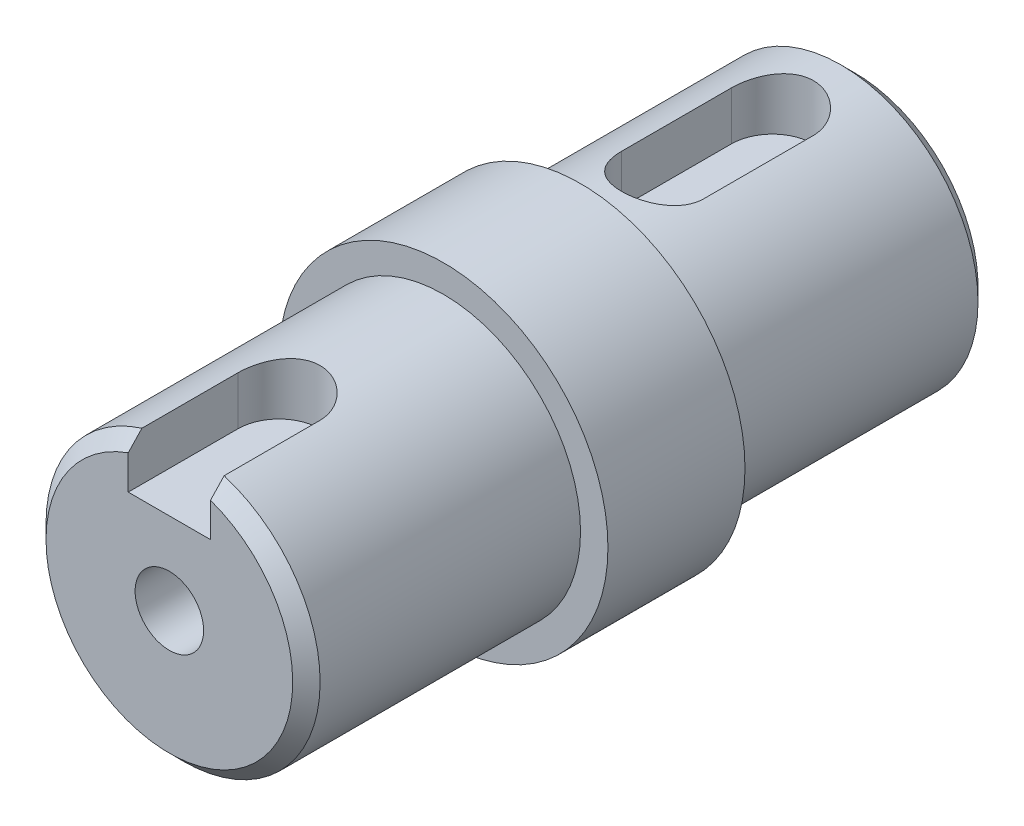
ISO-10303-21;
HEADER;
FILE_DESCRIPTION(('STEP AP214'),'2;1');
FILE_NAME('part.step','',(''),(''),'','','');
FILE_SCHEMA(('AUTOMOTIVE_DESIGN { 1 0 10303 214 1 1 1 1 }'));
ENDSEC;
DATA;
#1=APPLICATION_CONTEXT('core data for automotive mechanical design processes');
#2=APPLICATION_PROTOCOL_DEFINITION('international standard','automotive_design',2000,#1);
#3=PRODUCT_CONTEXT('',#1,'mechanical');
#4=PRODUCT('Part','Part','',(#3));
#5=PRODUCT_RELATED_PRODUCT_CATEGORY('part','',(#4));
#6=PRODUCT_DEFINITION_FORMATION('','',#4);
#7=PRODUCT_DEFINITION_CONTEXT('part definition',#1,'design');
#8=PRODUCT_DEFINITION('design','',#6,#7);
#9=PRODUCT_DEFINITION_SHAPE('','',#8);
#10=(LENGTH_UNIT() NAMED_UNIT(*) SI_UNIT(.MILLI.,.METRE.));
#11=(NAMED_UNIT(*) PLANE_ANGLE_UNIT() SI_UNIT($,.RADIAN.));
#12=(NAMED_UNIT(*) SI_UNIT($,.STERADIAN.) SOLID_ANGLE_UNIT());
#13=UNCERTAINTY_MEASURE_WITH_UNIT(LENGTH_MEASURE(1.E-05),#10,'distance_accuracy_value','');
#14=(GEOMETRIC_REPRESENTATION_CONTEXT(3) GLOBAL_UNCERTAINTY_ASSIGNED_CONTEXT((#13)) GLOBAL_UNIT_ASSIGNED_CONTEXT((#10,
#11,#12)) REPRESENTATION_CONTEXT('',''));
#15=CARTESIAN_POINT('',(0.,0.,0.));
#16=DIRECTION('',(0.,0.,1.));
#17=DIRECTION('',(1.,0.,0.));
#18=AXIS2_PLACEMENT_3D('',#15,#16,#17);
#19=CARTESIAN_POINT('',(0.,0.,10.));
#20=DIRECTION('',(0.,0.,-1.));
#21=DIRECTION('',(-1.,0.,0.));
#22=AXIS2_PLACEMENT_3D('',#19,#20,#21);
#23=CYLINDRICAL_SURFACE('',#22,5.);
#24=CARTESIAN_POINT('',(0.,0.,0.));
#25=DIRECTION('',(0.,0.,-1.));
#26=DIRECTION('',(-1.,0.,0.));
#27=AXIS2_PLACEMENT_3D('',#24,#25,#26);
#28=CIRCLE('',#27,5.);
#29=CARTESIAN_POINT('',(-5.,0.,0.));
#30=VERTEX_POINT('',#29);
#31=EDGE_CURVE('E170',#30,#30,#28,.T.);
#32=ORIENTED_EDGE('',*,*,#31,.F.);
#33=EDGE_LOOP('',(#32));
#34=FACE_BOUND('',#33,.T.);
#35=DIRECTION('',(0.,0.,-1.));
#36=VECTOR('',#35,1.);
#37=CARTESIAN_POINT('',(1.5,4.76969600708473,10.));
#38=LINE('',#37,#36);
#39=CARTESIAN_POINT('',(1.5,4.76969600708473,9.49999999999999));
#40=VERTEX_POINT('',#39);
#41=CARTESIAN_POINT('',(1.5,4.76969600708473,6.));
#42=VERTEX_POINT('',#41);
#43=EDGE_CURVE('E141',#40,#42,#38,.T.);
#44=ORIENTED_EDGE('',*,*,#43,.F.);
#45=CARTESIAN_POINT('',(0.,0.,9.49999999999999));
#46=DIRECTION('',(0.,0.,1.));
#47=DIRECTION('',(1.,0.,0.));
#48=AXIS2_PLACEMENT_3D('',#45,#46,#47);
#49=CIRCLE('',#48,5.);
#50=CARTESIAN_POINT('',(-1.5,4.76969600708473,9.49999999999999));
#51=VERTEX_POINT('',#50);
#52=EDGE_CURVE('E50',#40,#51,#49,.F.);
#53=ORIENTED_EDGE('',*,*,#52,.T.);
#54=DIRECTION('',(0.,0.,-1.));
#55=VECTOR('',#54,1.);
#56=CARTESIAN_POINT('',(-1.5,4.76969600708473,10.));
#57=LINE('',#56,#55);
#58=CARTESIAN_POINT('',(-1.5,4.76969600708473,6.));
#59=VERTEX_POINT('',#58);
#60=EDGE_CURVE('E139',#59,#51,#57,.F.);
#61=ORIENTED_EDGE('',*,*,#60,.F.);
#62=CARTESIAN_POINT('',(0.,5.,4.5));
#63=CARTESIAN_POINT('',(-0.0822886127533,4.9999992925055,4.50000099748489));
#64=CARTESIAN_POINT('',(-0.164587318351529,4.99794915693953,4.50679386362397));
#65=CARTESIAN_POINT('',(-0.326788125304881,4.98997105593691,4.5337213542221));
#66=CARTESIAN_POINT('',(-0.40668950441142,4.98404193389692,4.55385995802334));
#67=CARTESIAN_POINT('',(-0.561732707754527,4.96895552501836,4.60674601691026));
#68=CARTESIAN_POINT('',(-0.636881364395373,4.95980300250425,4.63947486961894));
#69=CARTESIAN_POINT('',(-0.780624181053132,4.93922109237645,4.71653609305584));
#70=CARTESIAN_POINT('',(-0.84921746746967,4.92779140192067,4.76087000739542));
#71=CARTESIAN_POINT('',(-0.979871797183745,4.90350737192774,4.86122400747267));
#72=CARTESIAN_POINT('',(-1.04171807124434,4.89062383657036,4.91751662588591));
#73=CARTESIAN_POINT('',(-1.15524920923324,4.86505834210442,5.03960922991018));
#74=CARTESIAN_POINT('',(-1.20693236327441,4.85237641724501,5.10541081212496));
#75=CARTESIAN_POINT('',(-1.29980037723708,4.82834113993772,5.24647075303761));
#76=CARTESIAN_POINT('',(-1.34072309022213,4.81702406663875,5.32190846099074));
#77=CARTESIAN_POINT('',(-1.4092139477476,4.79743620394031,5.47898925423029));
#78=CARTESIAN_POINT('',(-1.43678529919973,4.78916468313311,5.56063084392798));
#79=CARTESIAN_POINT('',(-1.47701633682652,4.77690870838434,5.72539026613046));
#80=CARTESIAN_POINT('',(-1.49007196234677,4.77281069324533,5.80840274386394));
#81=CARTESIAN_POINT('',(-1.50213730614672,4.76902789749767,5.97553315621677));
#82=CARTESIAN_POINT('',(-1.50115042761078,4.76934204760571,6.05965081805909));
#83=CARTESIAN_POINT('',(-1.48546977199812,4.77424744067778,6.22338390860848));
#84=CARTESIAN_POINT('',(-1.47127205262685,4.7786838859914,6.30305225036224));
#85=CARTESIAN_POINT('',(-1.43037420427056,4.79108356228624,6.45881978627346));
#86=CARTESIAN_POINT('',(-1.40367284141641,4.7990471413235,6.53491862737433));
#87=CARTESIAN_POINT('',(-1.33816026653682,4.81772733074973,6.68260034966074));
#88=CARTESIAN_POINT('',(-1.29918816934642,4.82848016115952,6.75410708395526));
#89=CARTESIAN_POINT('',(-1.21035222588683,4.85150987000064,6.88973202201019));
#90=CARTESIAN_POINT('',(-1.16048574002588,4.86378711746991,6.95384842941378));
#91=CARTESIAN_POINT('',(-1.04881290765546,4.88911011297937,7.07568619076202));
#92=CARTESIAN_POINT('',(-0.986594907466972,4.90216654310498,7.13302866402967));
#93=CARTESIAN_POINT('',(-0.853263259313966,4.92712244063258,7.23655398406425));
#94=CARTESIAN_POINT('',(-0.782149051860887,4.9390218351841,7.28273612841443));
#95=CARTESIAN_POINT('',(-0.632355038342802,4.9604316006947,7.36285992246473));
#96=CARTESIAN_POINT('',(-0.553627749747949,4.96992543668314,7.39671751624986));
#97=CARTESIAN_POINT('',(-0.391245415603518,4.98533521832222,7.45059959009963));
#98=CARTESIAN_POINT('',(-0.307591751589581,4.99125216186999,7.47062792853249));
#99=CARTESIAN_POINT('',(-0.140952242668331,4.99868364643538,7.4956521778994));
#100=CARTESIAN_POINT('',(-0.0580500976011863,5.0003485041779,7.50116158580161));
#101=CARTESIAN_POINT('',(0.107499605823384,4.99952923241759,7.49843084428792));
#102=CARTESIAN_POINT('',(0.190147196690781,4.99704565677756,7.49019253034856));
#103=CARTESIAN_POINT('',(0.350903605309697,4.98830696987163,7.4606153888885));
#104=CARTESIAN_POINT('',(0.429072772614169,4.98213829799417,7.43957661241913));
#105=CARTESIAN_POINT('',(0.580754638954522,4.96674347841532,7.3853567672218));
#106=CARTESIAN_POINT('',(0.654266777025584,4.95751696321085,7.35217423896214));
#107=CARTESIAN_POINT('',(0.796437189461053,4.93669654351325,7.27374683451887));
#108=CARTESIAN_POINT('',(0.86494382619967,4.92505280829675,7.22824065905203));
#109=CARTESIAN_POINT('',(0.993523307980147,4.90073468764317,7.12677524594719));
#110=CARTESIAN_POINT('',(1.05359403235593,4.8880600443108,7.07081338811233));
#111=CARTESIAN_POINT('',(1.16585744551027,4.86253171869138,6.94761269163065));
#112=CARTESIAN_POINT('',(1.21768481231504,4.84968825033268,6.88003812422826));
#113=CARTESIAN_POINT('',(1.30928995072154,4.82576515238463,6.73687206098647));
#114=CARTESIAN_POINT('',(1.34906803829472,4.81468547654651,6.66128077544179));
#115=CARTESIAN_POINT('',(1.41517347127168,4.79567189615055,6.50446750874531));
#116=CARTESIAN_POINT('',(1.4415634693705,4.78772337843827,6.42327381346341));
#117=CARTESIAN_POINT('',(1.48021730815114,4.77591594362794,6.25731203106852));
#118=CARTESIAN_POINT('',(1.49248598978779,4.772055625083,6.17254517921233));
#119=CARTESIAN_POINT('',(1.50221984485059,4.76899972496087,6.00563848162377));
#120=CARTESIAN_POINT('',(1.5002805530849,4.76961647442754,5.92353634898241));
#121=CARTESIAN_POINT('',(1.48307505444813,4.77499401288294,5.7608858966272));
#122=CARTESIAN_POINT('',(1.46780938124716,4.77975463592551,5.68033751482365));
#123=CARTESIAN_POINT('',(1.42476888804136,4.79275763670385,5.52405460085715));
#124=CARTESIAN_POINT('',(1.39715175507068,4.80095604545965,5.44827271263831));
#125=CARTESIAN_POINT('',(1.33031507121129,4.81990278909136,5.30235756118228));
#126=CARTESIAN_POINT('',(1.29109329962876,4.83065161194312,5.23222538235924));
#127=CARTESIAN_POINT('',(1.20048763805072,4.85397676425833,5.09683688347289));
#128=CARTESIAN_POINT('',(1.14871276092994,4.86660540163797,5.03185123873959));
#129=CARTESIAN_POINT('',(1.03517434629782,4.89201320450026,4.91129750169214));
#130=CARTESIAN_POINT('',(0.973408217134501,4.90479240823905,4.85573186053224));
#131=CARTESIAN_POINT('',(0.839465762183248,4.92950936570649,4.75397658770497));
#132=CARTESIAN_POINT('',(0.767037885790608,4.94141159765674,4.70810855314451));
#133=CARTESIAN_POINT('',(0.61514137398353,4.96260680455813,4.62926483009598));
#134=CARTESIAN_POINT('',(0.535676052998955,4.97190099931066,4.59628311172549));
#135=CARTESIAN_POINT('',(0.380757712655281,4.98602174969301,4.54710472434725));
#136=CARTESIAN_POINT('',(0.305786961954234,4.99122027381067,4.52948832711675));
#137=CARTESIAN_POINT('',(0.153880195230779,4.99820944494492,4.50593647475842));
#138=CARTESIAN_POINT('',(0.0769445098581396,5.0000006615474,4.49999906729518));
#139=CARTESIAN_POINT('',(0.,5.,4.5));
#140=B_SPLINE_CURVE_WITH_KNOTS('',3,(#62,#63,#64,#65,#66,#67,#68,#69,#70,#71,#72,#73,#74,#75,
#76,#77,#78,#79,#80,#81,#82,#83,#84,#85,#86,#87,#88,#89,#90,#91,#92,#93,#94,#95,#96,#97,#98,#99,
#100,#101,#102,#103,#104,#105,#106,#107,#108,#109,#110,#111,#112,#113,#114,#115,#116,#117,#118,
#119,#120,#121,#122,#123,#124,#125,#126,#127,#128,#129,#130,#131,#132,#133,#134,#135,#136,#137,
#138,#139),.UNSPECIFIED.,.T.,.F.,(4,2,2,2,2,2,2,2,2,2,2,2,2,2,2,2,2,2,2,2,2,2,2,2,2,2,2,2,2,2,2,
2,2,2,2,2,2,2,4),(0.,0.246583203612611,0.493239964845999,0.739533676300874,0.985860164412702,
1.23855602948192,1.49129437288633,1.74971481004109,2.00807314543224,2.25919689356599,
2.51025978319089,2.75226016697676,2.99428443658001,3.23962426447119,3.48502360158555,
3.74067104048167,3.99633456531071,4.25371046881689,4.51101453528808,4.75908809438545,
5.00712853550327,5.24956746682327,5.49203554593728,5.74011305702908,5.98825282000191,
6.24540400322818,6.5025484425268,6.75847814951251,7.01432009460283,7.25950155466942,
7.504673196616,7.74680040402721,7.98897397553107,8.23996925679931,8.49102974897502,
8.7494299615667,9.00770911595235,9.23831691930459,9.46888616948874),.UNSPECIFIED.);
#141=EDGE_CURVE('E219',#42,#59,#140,.T.);
#142=ORIENTED_EDGE('',*,*,#141,.F.);
#143=EDGE_LOOP('',(#44,#53,#61,#142));
#144=FACE_BOUND('',#143,.T.);
#145=ADVANCED_FACE('F37',(#34,#144),#23,.T.);
#146=CARTESIAN_POINT('',(0.,0.,10.));
#147=DIRECTION('',(0.,0.,1.));
#148=DIRECTION('',(1.,0.,0.));
#149=AXIS2_PLACEMENT_3D('',#146,#147,#148);
#150=PLANE('',#149);
#151=CARTESIAN_POINT('',(0.,0.,10.));
#152=DIRECTION('',(0.,0.,1.));
#153=DIRECTION('',(1.,0.,0.));
#154=AXIS2_PLACEMENT_3D('',#151,#152,#153);
#155=CIRCLE('',#154,1.25);
#156=CARTESIAN_POINT('',(1.25,0.,10.));
#157=VERTEX_POINT('',#156);
#158=EDGE_CURVE('E123',#157,#157,#155,.T.);
#159=ORIENTED_EDGE('',*,*,#158,.F.);
#160=EDGE_LOOP('',(#159));
#161=FACE_BOUND('',#160,.T.);
#162=DIRECTION('',(0.,1.,0.));
#163=VECTOR('',#162,1.);
#164=CARTESIAN_POINT('',(-1.5,0.,10.));
#165=LINE('',#164,#163);
#166=CARTESIAN_POINT('',(-1.5,3.,10.));
#167=VERTEX_POINT('',#166);
#168=CARTESIAN_POINT('',(-1.5,4.24264068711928,10.));
#169=VERTEX_POINT('',#168);
#170=EDGE_CURVE('E214',#167,#169,#165,.T.);
#171=ORIENTED_EDGE('',*,*,#170,.T.);
#172=CARTESIAN_POINT('',(0.,0.,10.));
#173=DIRECTION('',(0.,0.,1.));
#174=DIRECTION('',(1.,0.,0.));
#175=AXIS2_PLACEMENT_3D('',#172,#173,#174);
#176=CIRCLE('',#175,4.5);
#177=CARTESIAN_POINT('',(1.5,4.24264068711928,10.));
#178=VERTEX_POINT('',#177);
#179=EDGE_CURVE('E246',#169,#178,#176,.T.);
#180=ORIENTED_EDGE('',*,*,#179,.T.);
#181=DIRECTION('',(0.,-1.,0.));
#182=VECTOR('',#181,1.);
#183=CARTESIAN_POINT('',(1.5,0.,10.));
#184=LINE('',#183,#182);
#185=CARTESIAN_POINT('',(1.5,3.,10.));
#186=VERTEX_POINT('',#185);
#187=EDGE_CURVE('E217',#178,#186,#184,.T.);
#188=ORIENTED_EDGE('',*,*,#187,.T.);
#189=DIRECTION('',(-1.,0.,0.));
#190=VECTOR('',#189,1.);
#191=CARTESIAN_POINT('',(0.,3.,10.));
#192=LINE('',#191,#190);
#193=EDGE_CURVE('E211',#186,#167,#192,.T.);
#194=ORIENTED_EDGE('',*,*,#193,.T.);
#195=EDGE_LOOP('',(#171,#180,#188,#194));
#196=FACE_BOUND('',#195,.T.);
#197=ADVANCED_FACE('F267',(#161,#196),#150,.T.);
#198=CARTESIAN_POINT('',(0.,0.,-15.));
#199=DIRECTION('',(0.,0.,1.));
#200=DIRECTION('',(1.,0.,0.));
#201=AXIS2_PLACEMENT_3D('',#198,#199,#200);
#202=CYLINDRICAL_SURFACE('',#201,5.);
#203=CARTESIAN_POINT('',(0.,0.,-14.5));
#204=DIRECTION('',(0.,0.,-1.));
#205=DIRECTION('',(-1.,0.,0.));
#206=AXIS2_PLACEMENT_3D('',#203,#204,#205);
#207=CIRCLE('',#206,5.);
#208=CARTESIAN_POINT('',(-5.,0.,-14.5));
#209=VERTEX_POINT('',#208);
#210=EDGE_CURVE('E248',#209,#209,#207,.F.);
#211=ORIENTED_EDGE('',*,*,#210,.T.);
#212=EDGE_LOOP('',(#211));
#213=FACE_BOUND('',#212,.T.);
#214=CARTESIAN_POINT('',(0.,0.,-5.));
#215=DIRECTION('',(0.,0.,-1.));
#216=DIRECTION('',(-1.,0.,0.));
#217=AXIS2_PLACEMENT_3D('',#214,#215,#216);
#218=CIRCLE('',#217,5.);
#219=CARTESIAN_POINT('',(-5.,0.,-5.));
#220=VERTEX_POINT('',#219);
#221=EDGE_CURVE('E163',#220,#220,#218,.T.);
#222=ORIENTED_EDGE('',*,*,#221,.T.);
#223=EDGE_LOOP('',(#222));
#224=FACE_BOUND('',#223,.T.);
#225=CARTESIAN_POINT('',(0.,5.,-13.5));
#226=CARTESIAN_POINT('',(-0.0822886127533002,4.9999992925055,-13.4999990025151));
#227=CARTESIAN_POINT('',(-0.16458731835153,4.99794915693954,-13.493206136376));
#228=CARTESIAN_POINT('',(-0.326788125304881,4.98997105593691,-13.4662786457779));
#229=CARTESIAN_POINT('',(-0.40668950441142,4.98404193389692,-13.4461400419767));
#230=CARTESIAN_POINT('',(-0.561732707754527,4.96895552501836,-13.3932539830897));
#231=CARTESIAN_POINT('',(-0.636881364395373,4.95980300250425,-13.3605251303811));
#232=CARTESIAN_POINT('',(-0.780624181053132,4.93922109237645,-13.2834639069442));
#233=CARTESIAN_POINT('',(-0.84921746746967,4.92779140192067,-13.2391299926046));
#234=CARTESIAN_POINT('',(-0.979871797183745,4.90350737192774,-13.1387759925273));
#235=CARTESIAN_POINT('',(-1.04171807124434,4.89062383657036,-13.0824833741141));
#236=CARTESIAN_POINT('',(-1.15524920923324,4.86505834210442,-12.9603907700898));
#237=CARTESIAN_POINT('',(-1.20693236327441,4.85237641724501,-12.894589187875));
#238=CARTESIAN_POINT('',(-1.29980037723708,4.82834113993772,-12.7535292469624));
#239=CARTESIAN_POINT('',(-1.34072309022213,4.81702406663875,-12.6780915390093));
#240=CARTESIAN_POINT('',(-1.4092139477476,4.79743620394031,-12.5210107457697));
#241=CARTESIAN_POINT('',(-1.43678529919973,4.78916468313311,-12.439369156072));
#242=CARTESIAN_POINT('',(-1.47701633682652,4.77690870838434,-12.2746097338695));
#243=CARTESIAN_POINT('',(-1.49007196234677,4.77281069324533,-12.1915972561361));
#244=CARTESIAN_POINT('',(-1.50213730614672,4.76902789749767,-12.0244668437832));
#245=CARTESIAN_POINT('',(-1.50115042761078,4.76934204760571,-11.9403491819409));
#246=CARTESIAN_POINT('',(-1.48546977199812,4.77424744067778,-11.7766160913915));
#247=CARTESIAN_POINT('',(-1.47127205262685,4.77868388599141,-11.6969477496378));
#248=CARTESIAN_POINT('',(-1.43037420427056,4.79108356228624,-11.5411802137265));
#249=CARTESIAN_POINT('',(-1.40367284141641,4.79904714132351,-11.4650813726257));
#250=CARTESIAN_POINT('',(-1.33816026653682,4.81772733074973,-11.3173996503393));
#251=CARTESIAN_POINT('',(-1.29918816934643,4.82848016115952,-11.2458929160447));
#252=CARTESIAN_POINT('',(-1.21035222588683,4.85150987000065,-11.1102679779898));
#253=CARTESIAN_POINT('',(-1.16048574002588,4.86378711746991,-11.0461515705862));
#254=CARTESIAN_POINT('',(-1.04881290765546,4.88911011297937,-10.924313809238));
#255=CARTESIAN_POINT('',(-0.986594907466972,4.90216654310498,-10.8669713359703));
#256=CARTESIAN_POINT('',(-0.853263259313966,4.92712244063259,-10.7634460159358));
#257=CARTESIAN_POINT('',(-0.782149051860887,4.9390218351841,-10.7172638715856));
#258=CARTESIAN_POINT('',(-0.632355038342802,4.9604316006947,-10.6371400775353));
#259=CARTESIAN_POINT('',(-0.553627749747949,4.96992543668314,-10.6032824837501));
#260=CARTESIAN_POINT('',(-0.391245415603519,4.98533521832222,-10.5494004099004));
#261=CARTESIAN_POINT('',(-0.307591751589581,4.99125216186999,-10.5293720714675));
#262=CARTESIAN_POINT('',(-0.140952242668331,4.99868364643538,-10.5043478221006));
#263=CARTESIAN_POINT('',(-0.0580500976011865,5.0003485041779,-10.4988384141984));
#264=CARTESIAN_POINT('',(0.107499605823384,4.9995292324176,-10.5015691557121));
#265=CARTESIAN_POINT('',(0.190147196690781,4.99704565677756,-10.5098074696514));
#266=CARTESIAN_POINT('',(0.350903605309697,4.98830696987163,-10.5393846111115));
#267=CARTESIAN_POINT('',(0.42907277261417,4.98213829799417,-10.5604233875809));
#268=CARTESIAN_POINT('',(0.580754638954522,4.96674347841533,-10.6146432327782));
#269=CARTESIAN_POINT('',(0.654266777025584,4.95751696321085,-10.6478257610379));
#270=CARTESIAN_POINT('',(0.796437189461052,4.93669654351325,-10.7262531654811));
#271=CARTESIAN_POINT('',(0.86494382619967,4.92505280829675,-10.771759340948));
#272=CARTESIAN_POINT('',(0.993523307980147,4.90073468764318,-10.8732247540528));
#273=CARTESIAN_POINT('',(1.05359403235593,4.8880600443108,-10.9291866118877));
#274=CARTESIAN_POINT('',(1.16585744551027,4.86253171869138,-11.0523873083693));
#275=CARTESIAN_POINT('',(1.21768481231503,4.84968825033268,-11.1199618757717));
#276=CARTESIAN_POINT('',(1.30928995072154,4.82576515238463,-11.2631279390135));
#277=CARTESIAN_POINT('',(1.34906803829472,4.81468547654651,-11.3387192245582));
#278=CARTESIAN_POINT('',(1.41517347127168,4.79567189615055,-11.4955324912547));
#279=CARTESIAN_POINT('',(1.4415634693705,4.78772337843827,-11.5767261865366));
#280=CARTESIAN_POINT('',(1.48021730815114,4.77591594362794,-11.7426879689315));
#281=CARTESIAN_POINT('',(1.49248598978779,4.772055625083,-11.8274548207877));
#282=CARTESIAN_POINT('',(1.50221984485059,4.76899972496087,-11.9943615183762));
#283=CARTESIAN_POINT('',(1.5002805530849,4.76961647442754,-12.0764636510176));
#284=CARTESIAN_POINT('',(1.48307505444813,4.77499401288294,-12.2391141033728));
#285=CARTESIAN_POINT('',(1.46780938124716,4.77975463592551,-12.3196624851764));
#286=CARTESIAN_POINT('',(1.42476888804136,4.79275763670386,-12.4759453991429));
#287=CARTESIAN_POINT('',(1.39715175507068,4.80095604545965,-12.5517272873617));
#288=CARTESIAN_POINT('',(1.33031507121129,4.81990278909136,-12.6976424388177));
#289=CARTESIAN_POINT('',(1.29109329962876,4.83065161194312,-12.7677746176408));
#290=CARTESIAN_POINT('',(1.20048763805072,4.85397676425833,-12.9031631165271));
#291=CARTESIAN_POINT('',(1.14871276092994,4.86660540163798,-12.9681487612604));
#292=CARTESIAN_POINT('',(1.03517434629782,4.89201320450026,-13.0887024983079));
#293=CARTESIAN_POINT('',(0.973408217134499,4.90479240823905,-13.1442681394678));
#294=CARTESIAN_POINT('',(0.839465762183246,4.92950936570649,-13.246023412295));
#295=CARTESIAN_POINT('',(0.767037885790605,4.94141159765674,-13.2918914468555));
#296=CARTESIAN_POINT('',(0.615141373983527,4.96260680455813,-13.370735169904));
#297=CARTESIAN_POINT('',(0.535676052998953,4.97190099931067,-13.4037168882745));
#298=CARTESIAN_POINT('',(0.380757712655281,4.98602174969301,-13.4528952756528));
#299=CARTESIAN_POINT('',(0.305786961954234,4.99122027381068,-13.4705116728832));
#300=CARTESIAN_POINT('',(0.153880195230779,4.99820944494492,-13.4940635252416));
#301=CARTESIAN_POINT('',(0.0769445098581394,5.0000006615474,-13.5000009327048));
#302=CARTESIAN_POINT('',(0.,5.,-13.5));
#303=B_SPLINE_CURVE_WITH_KNOTS('',3,(#225,#226,#227,#228,#229,#230,#231,#232,#233,#234,#235,
#236,#237,#238,#239,#240,#241,#242,#243,#244,#245,#246,#247,#248,#249,#250,#251,#252,#253,#254,
#255,#256,#257,#258,#259,#260,#261,#262,#263,#264,#265,#266,#267,#268,#269,#270,#271,#272,#273,
#274,#275,#276,#277,#278,#279,#280,#281,#282,#283,#284,#285,#286,#287,#288,#289,#290,#291,#292,
#293,#294,#295,#296,#297,#298,#299,#300,#301,#302),.UNSPECIFIED.,.T.,.F.,(4,2,2,2,2,2,2,2,2,2,2,
2,2,2,2,2,2,2,2,2,2,2,2,2,2,2,2,2,2,2,2,2,2,2,2,2,2,2,4),(0.,0.246583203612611,0.493239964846,
0.739533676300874,0.985860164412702,1.23855602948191,1.49129437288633,1.74971481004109,
2.00807314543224,2.25919689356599,2.51025978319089,2.75226016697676,2.99428443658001,
3.23962426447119,3.48502360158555,3.74067104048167,3.99633456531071,4.25371046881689,
4.51101453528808,4.75908809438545,5.00712853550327,5.24956746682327,5.49203554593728,
5.74011305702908,5.98825282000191,6.24540400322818,6.5025484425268,6.75847814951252,
7.01432009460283,7.25950155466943,7.504673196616,7.74680040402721,7.98897397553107,
8.2399692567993,8.49102974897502,8.7494299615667,9.00770911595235,9.23831691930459,
9.46888616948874),.UNSPECIFIED.);
#304=CARTESIAN_POINT('',(1.5,4.76969600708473,-12.));
#305=VERTEX_POINT('',#304);
#306=CARTESIAN_POINT('',(-1.5,4.76969600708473,-12.));
#307=VERTEX_POINT('',#306);
#308=EDGE_CURVE('E207',#305,#307,#303,.T.);
#309=ORIENTED_EDGE('',*,*,#308,.F.);
#310=DIRECTION('',(0.,0.,1.));
#311=VECTOR('',#310,1.);
#312=CARTESIAN_POINT('',(1.5,4.76969600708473,-15.));
#313=LINE('',#312,#311);
#314=CARTESIAN_POINT('',(1.5,4.76969600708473,-8.));
#315=VERTEX_POINT('',#314);
#316=EDGE_CURVE('E175',#315,#305,#313,.F.);
#317=ORIENTED_EDGE('',*,*,#316,.F.);
#318=CARTESIAN_POINT('',(0.,5.,-9.5));
#319=CARTESIAN_POINT('',(-0.0822886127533,4.9999992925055,-9.49999900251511));
#320=CARTESIAN_POINT('',(-0.164587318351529,4.99794915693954,-9.49320613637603));
#321=CARTESIAN_POINT('',(-0.326788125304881,4.98997105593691,-9.4662786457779));
#322=CARTESIAN_POINT('',(-0.40668950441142,4.98404193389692,-9.44614004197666));
#323=CARTESIAN_POINT('',(-0.561732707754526,4.96895552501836,-9.39325398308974));
#324=CARTESIAN_POINT('',(-0.636881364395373,4.95980300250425,-9.36052513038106));
#325=CARTESIAN_POINT('',(-0.780624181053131,4.93922109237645,-9.28346390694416));
#326=CARTESIAN_POINT('',(-0.849217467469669,4.92779140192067,-9.23912999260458));
#327=CARTESIAN_POINT('',(-0.979871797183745,4.90350737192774,-9.13877599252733));
#328=CARTESIAN_POINT('',(-1.04171807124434,4.89062383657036,-9.08248337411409));
#329=CARTESIAN_POINT('',(-1.15524920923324,4.86505834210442,-8.96039077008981));
#330=CARTESIAN_POINT('',(-1.20693236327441,4.85237641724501,-8.89458918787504));
#331=CARTESIAN_POINT('',(-1.29980037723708,4.82834113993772,-8.75352924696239));
#332=CARTESIAN_POINT('',(-1.34072309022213,4.81702406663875,-8.67809153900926));
#333=CARTESIAN_POINT('',(-1.4092139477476,4.79743620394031,-8.52101074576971));
#334=CARTESIAN_POINT('',(-1.43678529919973,4.78916468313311,-8.43936915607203));
#335=CARTESIAN_POINT('',(-1.47701633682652,4.77690870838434,-8.27460973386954));
#336=CARTESIAN_POINT('',(-1.49007196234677,4.77281069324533,-8.19159725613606));
#337=CARTESIAN_POINT('',(-1.50213730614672,4.76902789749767,-8.02446684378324));
#338=CARTESIAN_POINT('',(-1.50115042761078,4.76934204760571,-7.94034918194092));
#339=CARTESIAN_POINT('',(-1.48546977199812,4.77424744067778,-7.77661609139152));
#340=CARTESIAN_POINT('',(-1.47127205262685,4.7786838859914,-7.69694774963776));
#341=CARTESIAN_POINT('',(-1.43037420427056,4.79108356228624,-7.54118021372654));
#342=CARTESIAN_POINT('',(-1.40367284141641,4.79904714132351,-7.46508137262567));
#343=CARTESIAN_POINT('',(-1.33816026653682,4.81772733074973,-7.31739965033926));
#344=CARTESIAN_POINT('',(-1.29918816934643,4.82848016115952,-7.24589291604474));
#345=CARTESIAN_POINT('',(-1.21035222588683,4.85150987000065,-7.11026797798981));
#346=CARTESIAN_POINT('',(-1.16048574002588,4.86378711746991,-7.04615157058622));
#347=CARTESIAN_POINT('',(-1.04881290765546,4.88911011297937,-6.92431380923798));
#348=CARTESIAN_POINT('',(-0.986594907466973,4.90216654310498,-6.86697133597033));
#349=CARTESIAN_POINT('',(-0.853263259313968,4.92712244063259,-6.76344601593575));
#350=CARTESIAN_POINT('',(-0.782149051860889,4.9390218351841,-6.71726387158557));
#351=CARTESIAN_POINT('',(-0.632355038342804,4.9604316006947,-6.63714007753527));
#352=CARTESIAN_POINT('',(-0.553627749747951,4.96992543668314,-6.60328248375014));
#353=CARTESIAN_POINT('',(-0.39124541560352,4.98533521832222,-6.54940040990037));
#354=CARTESIAN_POINT('',(-0.307591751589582,4.99125216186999,-6.52937207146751));
#355=CARTESIAN_POINT('',(-0.140952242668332,4.99868364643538,-6.50434782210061));
#356=CARTESIAN_POINT('',(-0.0580500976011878,5.0003485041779,-6.49883841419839));
#357=CARTESIAN_POINT('',(0.107499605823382,4.9995292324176,-6.50156915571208));
#358=CARTESIAN_POINT('',(0.19014719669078,4.99704565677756,-6.50980746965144));
#359=CARTESIAN_POINT('',(0.350903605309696,4.98830696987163,-6.5393846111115));
#360=CARTESIAN_POINT('',(0.429072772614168,4.98213829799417,-6.56042338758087));
#361=CARTESIAN_POINT('',(0.580754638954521,4.96674347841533,-6.6146432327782));
#362=CARTESIAN_POINT('',(0.654266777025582,4.95751696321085,-6.64782576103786));
#363=CARTESIAN_POINT('',(0.796437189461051,4.93669654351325,-6.72625316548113));
#364=CARTESIAN_POINT('',(0.864943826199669,4.92505280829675,-6.77175934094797));
#365=CARTESIAN_POINT('',(0.993523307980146,4.90073468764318,-6.87322475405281));
#366=CARTESIAN_POINT('',(1.05359403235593,4.8880600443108,-6.92918661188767));
#367=CARTESIAN_POINT('',(1.16585744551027,4.86253171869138,-7.05238730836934));
#368=CARTESIAN_POINT('',(1.21768481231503,4.84968825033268,-7.11996187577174));
#369=CARTESIAN_POINT('',(1.30928995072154,4.82576515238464,-7.26312793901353));
#370=CARTESIAN_POINT('',(1.34906803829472,4.81468547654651,-7.33871922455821));
#371=CARTESIAN_POINT('',(1.41517347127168,4.79567189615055,-7.49553249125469));
#372=CARTESIAN_POINT('',(1.4415634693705,4.78772337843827,-7.57672618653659));
#373=CARTESIAN_POINT('',(1.48021730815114,4.77591594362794,-7.74268796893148));
#374=CARTESIAN_POINT('',(1.49248598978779,4.772055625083,-7.82745482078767));
#375=CARTESIAN_POINT('',(1.50221984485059,4.76899972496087,-7.99436151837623));
#376=CARTESIAN_POINT('',(1.5002805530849,4.76961647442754,-8.07646365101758));
#377=CARTESIAN_POINT('',(1.48307505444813,4.77499401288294,-8.2391141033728));
#378=CARTESIAN_POINT('',(1.46780938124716,4.77975463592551,-8.31966248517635));
#379=CARTESIAN_POINT('',(1.42476888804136,4.79275763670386,-8.47594539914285));
#380=CARTESIAN_POINT('',(1.39715175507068,4.80095604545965,-8.55172728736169));
#381=CARTESIAN_POINT('',(1.33031507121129,4.81990278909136,-8.69764243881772));
#382=CARTESIAN_POINT('',(1.29109329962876,4.83065161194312,-8.76777461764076));
#383=CARTESIAN_POINT('',(1.20048763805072,4.85397676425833,-8.90316311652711));
#384=CARTESIAN_POINT('',(1.14871276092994,4.86660540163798,-8.96814876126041));
#385=CARTESIAN_POINT('',(1.03517434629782,4.89201320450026,-9.08870249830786));
#386=CARTESIAN_POINT('',(0.973408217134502,4.90479240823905,-9.14426813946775));
#387=CARTESIAN_POINT('',(0.83946576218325,4.92950936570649,-9.24602341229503));
#388=CARTESIAN_POINT('',(0.767037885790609,4.94141159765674,-9.29189144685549));
#389=CARTESIAN_POINT('',(0.61514137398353,4.96260680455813,-9.37073516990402));
#390=CARTESIAN_POINT('',(0.535676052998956,4.97190099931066,-9.40371688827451));
#391=CARTESIAN_POINT('',(0.380757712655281,4.98602174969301,-9.45289527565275));
#392=CARTESIAN_POINT('',(0.305786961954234,4.99122027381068,-9.47051167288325));
#393=CARTESIAN_POINT('',(0.153880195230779,4.99820944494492,-9.49406352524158));
#394=CARTESIAN_POINT('',(0.0769445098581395,5.0000006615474,-9.50000093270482));
#395=CARTESIAN_POINT('',(0.,5.,-9.5));
#396=B_SPLINE_CURVE_WITH_KNOTS('',3,(#318,#319,#320,#321,#322,#323,#324,#325,#326,#327,#328,
#329,#330,#331,#332,#333,#334,#335,#336,#337,#338,#339,#340,#341,#342,#343,#344,#345,#346,#347,
#348,#349,#350,#351,#352,#353,#354,#355,#356,#357,#358,#359,#360,#361,#362,#363,#364,#365,#366,
#367,#368,#369,#370,#371,#372,#373,#374,#375,#376,#377,#378,#379,#380,#381,#382,#383,#384,#385,
#386,#387,#388,#389,#390,#391,#392,#393,#394,#395),.UNSPECIFIED.,.T.,.F.,(4,2,2,2,2,2,2,2,2,2,2,
2,2,2,2,2,2,2,2,2,2,2,2,2,2,2,2,2,2,2,2,2,2,2,2,2,2,2,4),(0.,0.246583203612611,
0.493239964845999,0.739533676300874,0.985860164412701,1.23855602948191,1.49129437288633,
1.74971481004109,2.00807314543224,2.25919689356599,2.51025978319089,2.75226016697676,
2.99428443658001,3.23962426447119,3.48502360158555,3.74067104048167,3.99633456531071,
4.25371046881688,4.51101453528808,4.75908809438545,5.00712853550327,5.24956746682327,
5.49203554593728,5.74011305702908,5.98825282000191,6.24540400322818,6.5025484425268,
6.75847814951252,7.01432009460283,7.25950155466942,7.504673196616,7.74680040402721,
7.98897397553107,8.2399692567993,8.49102974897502,8.74942996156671,9.00770911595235,
9.2383169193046,9.46888616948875),.UNSPECIFIED.);
#397=CARTESIAN_POINT('',(-1.5,4.76969600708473,-8.));
#398=VERTEX_POINT('',#397);
#399=EDGE_CURVE('E177',#398,#315,#396,.T.);
#400=ORIENTED_EDGE('',*,*,#399,.F.);
#401=DIRECTION('',(0.,0.,1.));
#402=VECTOR('',#401,1.);
#403=CARTESIAN_POINT('',(-1.5,4.76969600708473,-15.));
#404=LINE('',#403,#402);
#405=EDGE_CURVE('E184',#307,#398,#404,.T.);
#406=ORIENTED_EDGE('',*,*,#405,.F.);
#407=EDGE_LOOP('',(#309,#317,#400,#406));
#408=FACE_BOUND('',#407,.T.);
#409=ADVANCED_FACE('F186',(#213,#224,#408),#202,.T.);
#410=CARTESIAN_POINT('',(0.,0.,-5.));
#411=DIRECTION('',(0.,0.,1.));
#412=DIRECTION('',(1.,0.,0.));
#413=AXIS2_PLACEMENT_3D('',#410,#411,#412);
#414=CYLINDRICAL_SURFACE('',#413,6.);
#415=CARTESIAN_POINT('',(0.,0.,-5.));
#416=DIRECTION('',(0.,0.,-1.));
#417=DIRECTION('',(-1.,0.,0.));
#418=AXIS2_PLACEMENT_3D('',#415,#416,#417);
#419=CIRCLE('',#418,6.);
#420=CARTESIAN_POINT('',(-6.,0.,-5.));
#421=VERTEX_POINT('',#420);
#422=EDGE_CURVE('E167',#421,#421,#419,.T.);
#423=ORIENTED_EDGE('',*,*,#422,.F.);
#424=EDGE_LOOP('',(#423));
#425=FACE_BOUND('',#424,.T.);
#426=CARTESIAN_POINT('',(0.,0.,0.));
#427=DIRECTION('',(0.,0.,-1.));
#428=DIRECTION('',(-1.,0.,0.));
#429=AXIS2_PLACEMENT_3D('',#426,#427,#428);
#430=CIRCLE('',#429,6.);
#431=CARTESIAN_POINT('',(-6.,0.,0.));
#432=VERTEX_POINT('',#431);
#433=EDGE_CURVE('E166',#432,#432,#430,.T.);
#434=ORIENTED_EDGE('',*,*,#433,.T.);
#435=EDGE_LOOP('',(#434));
#436=FACE_BOUND('',#435,.T.);
#437=ADVANCED_FACE('F316',(#425,#436),#414,.T.);
#438=CARTESIAN_POINT('',(0.,0.,-5.));
#439=DIRECTION('',(0.,0.,-1.));
#440=DIRECTION('',(-1.,0.,0.));
#441=AXIS2_PLACEMENT_3D('',#438,#439,#440);
#442=PLANE('',#441);
#443=ORIENTED_EDGE('',*,*,#221,.F.);
#444=EDGE_LOOP('',(#443));
#445=FACE_BOUND('',#444,.T.);
#446=ORIENTED_EDGE('',*,*,#422,.T.);
#447=EDGE_LOOP('',(#446));
#448=FACE_BOUND('',#447,.T.);
#449=ADVANCED_FACE('F367',(#445,#448),#442,.T.);
#450=CARTESIAN_POINT('',(0.,0.,0.));
#451=DIRECTION('',(0.,0.,-1.));
#452=DIRECTION('',(-1.,0.,0.));
#453=AXIS2_PLACEMENT_3D('',#450,#451,#452);
#454=PLANE('',#453);
#455=ORIENTED_EDGE('',*,*,#31,.T.);
#456=EDGE_LOOP('',(#455));
#457=FACE_BOUND('',#456,.T.);
#458=ORIENTED_EDGE('',*,*,#433,.F.);
#459=EDGE_LOOP('',(#458));
#460=FACE_BOUND('',#459,.T.);
#461=ADVANCED_FACE('F324',(#457,#460),#454,.F.);
#462=CARTESIAN_POINT('',(0.,0.,-15.));
#463=DIRECTION('',(0.,0.,-1.));
#464=DIRECTION('',(-1.,0.,0.));
#465=AXIS2_PLACEMENT_3D('',#462,#463,#464);
#466=PLANE('',#465);
#467=CARTESIAN_POINT('',(0.,0.,-15.));
#468=DIRECTION('',(0.,0.,-1.));
#469=DIRECTION('',(-1.,0.,0.));
#470=AXIS2_PLACEMENT_3D('',#467,#468,#469);
#471=CIRCLE('',#470,4.5);
#472=CARTESIAN_POINT('',(-4.5,0.,-15.));
#473=VERTEX_POINT('',#472);
#474=EDGE_CURVE('E225',#473,#473,#471,.T.);
#475=ORIENTED_EDGE('',*,*,#474,.T.);
#476=EDGE_LOOP('',(#475));
#477=FACE_BOUND('',#476,.T.);
#478=ADVANCED_FACE('F205',(#477),#466,.T.);
#479=CARTESIAN_POINT('',(0.,12.,-12.));
#480=DIRECTION('',(0.,-1.,0.));
#481=DIRECTION('',(0.,0.,-1.));
#482=AXIS2_PLACEMENT_3D('',#479,#480,#481);
#483=CYLINDRICAL_SURFACE('',#482,1.5);
#484=ORIENTED_EDGE('',*,*,#308,.T.);
#485=DIRECTION('',(0.,-1.,0.));
#486=VECTOR('',#485,1.);
#487=CARTESIAN_POINT('',(-1.5,12.,-12.));
#488=LINE('',#487,#486);
#489=CARTESIAN_POINT('',(-1.5,3.,-12.));
#490=VERTEX_POINT('',#489);
#491=EDGE_CURVE('E161',#307,#490,#488,.T.);
#492=ORIENTED_EDGE('',*,*,#491,.T.);
#493=CARTESIAN_POINT('',(0.,3.,-12.));
#494=DIRECTION('',(0.,1.,0.));
#495=DIRECTION('',(0.,0.,1.));
#496=AXIS2_PLACEMENT_3D('',#493,#494,#495);
#497=CIRCLE('',#496,1.5);
#498=CARTESIAN_POINT('',(1.5,3.,-12.));
#499=VERTEX_POINT('',#498);
#500=EDGE_CURVE('E143',#499,#490,#497,.T.);
#501=ORIENTED_EDGE('',*,*,#500,.F.);
#502=DIRECTION('',(0.,-1.,0.));
#503=VECTOR('',#502,1.);
#504=CARTESIAN_POINT('',(1.5,12.,-12.));
#505=LINE('',#504,#503);
#506=EDGE_CURVE('E155',#305,#499,#505,.T.);
#507=ORIENTED_EDGE('',*,*,#506,.F.);
#508=EDGE_LOOP('',(#484,#492,#501,#507));
#509=FACE_BOUND('',#508,.T.);
#510=ADVANCED_FACE('F201',(#509),#483,.F.);
#511=CARTESIAN_POINT('',(-1.5,12.,-12.));
#512=DIRECTION('',(1.,0.,0.));
#513=DIRECTION('',(0.,0.,-1.));
#514=AXIS2_PLACEMENT_3D('',#511,#512,#513);
#515=PLANE('',#514);
#516=ORIENTED_EDGE('',*,*,#405,.T.);
#517=DIRECTION('',(0.,-1.,0.));
#518=VECTOR('',#517,1.);
#519=CARTESIAN_POINT('',(-1.5,12.,-8.));
#520=LINE('',#519,#518);
#521=CARTESIAN_POINT('',(-1.5,3.,-8.));
#522=VERTEX_POINT('',#521);
#523=EDGE_CURVE('E159',#398,#522,#520,.T.);
#524=ORIENTED_EDGE('',*,*,#523,.T.);
#525=DIRECTION('',(0.,0.,1.));
#526=VECTOR('',#525,1.);
#527=CARTESIAN_POINT('',(-1.5,3.,-12.));
#528=LINE('',#527,#526);
#529=EDGE_CURVE('E146',#490,#522,#528,.T.);
#530=ORIENTED_EDGE('',*,*,#529,.F.);
#531=ORIENTED_EDGE('',*,*,#491,.F.);
#532=EDGE_LOOP('',(#516,#524,#530,#531));
#533=FACE_BOUND('',#532,.T.);
#534=ADVANCED_FACE('F196',(#533),#515,.T.);
#535=CARTESIAN_POINT('',(0.,12.,-8.));
#536=DIRECTION('',(0.,-1.,0.));
#537=DIRECTION('',(0.,0.,-1.));
#538=AXIS2_PLACEMENT_3D('',#535,#536,#537);
#539=CYLINDRICAL_SURFACE('',#538,1.5);
#540=ORIENTED_EDGE('',*,*,#399,.T.);
#541=DIRECTION('',(0.,-1.,0.));
#542=VECTOR('',#541,1.);
#543=CARTESIAN_POINT('',(1.5,12.,-8.));
#544=LINE('',#543,#542);
#545=CARTESIAN_POINT('',(1.5,3.,-8.));
#546=VERTEX_POINT('',#545);
#547=EDGE_CURVE('E157',#315,#546,#544,.T.);
#548=ORIENTED_EDGE('',*,*,#547,.T.);
#549=CARTESIAN_POINT('',(0.,3.,-8.));
#550=DIRECTION('',(0.,1.,0.));
#551=DIRECTION('',(0.,0.,1.));
#552=AXIS2_PLACEMENT_3D('',#549,#550,#551);
#553=CIRCLE('',#552,1.5);
#554=EDGE_CURVE('E149',#522,#546,#553,.T.);
#555=ORIENTED_EDGE('',*,*,#554,.F.);
#556=ORIENTED_EDGE('',*,*,#523,.F.);
#557=EDGE_LOOP('',(#540,#548,#555,#556));
#558=FACE_BOUND('',#557,.T.);
#559=ADVANCED_FACE('F190',(#558),#539,.F.);
#560=CARTESIAN_POINT('',(1.5,12.,-12.));
#561=DIRECTION('',(-1.,0.,0.));
#562=DIRECTION('',(0.,0.,1.));
#563=AXIS2_PLACEMENT_3D('',#560,#561,#562);
#564=PLANE('',#563);
#565=ORIENTED_EDGE('',*,*,#316,.T.);
#566=ORIENTED_EDGE('',*,*,#506,.T.);
#567=DIRECTION('',(0.,0.,-1.));
#568=VECTOR('',#567,1.);
#569=CARTESIAN_POINT('',(1.5,3.,-12.));
#570=LINE('',#569,#568);
#571=EDGE_CURVE('E152',#546,#499,#570,.T.);
#572=ORIENTED_EDGE('',*,*,#571,.F.);
#573=ORIENTED_EDGE('',*,*,#547,.F.);
#574=EDGE_LOOP('',(#565,#566,#572,#573));
#575=FACE_BOUND('',#574,.T.);
#576=ADVANCED_FACE('F195',(#575),#564,.T.);
#577=CARTESIAN_POINT('',(0.,3.,-12.));
#578=DIRECTION('',(0.,1.,0.));
#579=DIRECTION('',(0.,0.,1.));
#580=AXIS2_PLACEMENT_3D('',#577,#578,#579);
#581=PLANE('',#580);
#582=ORIENTED_EDGE('',*,*,#500,.T.);
#583=ORIENTED_EDGE('',*,*,#529,.T.);
#584=ORIENTED_EDGE('',*,*,#554,.T.);
#585=ORIENTED_EDGE('',*,*,#571,.T.);
#586=EDGE_LOOP('',(#582,#583,#584,#585));
#587=FACE_BOUND('',#586,.T.);
#588=ADVANCED_FACE('F234',(#587),#581,.T.);
#589=CARTESIAN_POINT('',(0.,12.,6.));
#590=DIRECTION('',(0.,-1.,0.));
#591=DIRECTION('',(0.,0.,-1.));
#592=AXIS2_PLACEMENT_3D('',#589,#590,#591);
#593=CYLINDRICAL_SURFACE('',#592,1.5);
#594=ORIENTED_EDGE('',*,*,#141,.T.);
#595=DIRECTION('',(0.,-1.,0.));
#596=VECTOR('',#595,1.);
#597=CARTESIAN_POINT('',(-1.5,12.,6.));
#598=LINE('',#597,#596);
#599=CARTESIAN_POINT('',(-1.5,3.,6.));
#600=VERTEX_POINT('',#599);
#601=EDGE_CURVE('E135',#59,#600,#598,.T.);
#602=ORIENTED_EDGE('',*,*,#601,.T.);
#603=CARTESIAN_POINT('',(0.,3.,6.));
#604=DIRECTION('',(0.,1.,0.));
#605=DIRECTION('',(0.,0.,1.));
#606=AXIS2_PLACEMENT_3D('',#603,#604,#605);
#607=CIRCLE('',#606,1.5);
#608=CARTESIAN_POINT('',(1.5,3.,6.));
#609=VERTEX_POINT('',#608);
#610=EDGE_CURVE('E126',#609,#600,#607,.T.);
#611=ORIENTED_EDGE('',*,*,#610,.F.);
#612=DIRECTION('',(0.,-1.,0.));
#613=VECTOR('',#612,1.);
#614=CARTESIAN_POINT('',(1.5,12.,6.));
#615=LINE('',#614,#613);
#616=EDGE_CURVE('E137',#42,#609,#615,.T.);
#617=ORIENTED_EDGE('',*,*,#616,.F.);
#618=EDGE_LOOP('',(#594,#602,#611,#617));
#619=FACE_BOUND('',#618,.T.);
#620=ADVANCED_FACE('F229',(#619),#593,.F.);
#621=CARTESIAN_POINT('',(1.5,12.,12.401695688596));
#622=DIRECTION('',(-1.,0.,0.));
#623=DIRECTION('',(0.,0.,1.));
#624=AXIS2_PLACEMENT_3D('',#621,#622,#623);
#625=PLANE('',#624);
#626=ORIENTED_EDGE('',*,*,#187,.F.);
#627=CARTESIAN_POINT('',(1.5,4.24264068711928,10.));
#628=CARTESIAN_POINT('',(1.5,4.33072666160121,9.91692323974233));
#629=CARTESIAN_POINT('',(1.5,4.4186909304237,9.83371818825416));
#630=CARTESIAN_POINT('',(1.5,4.59437603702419,9.66705152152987));
#631=CARTESIAN_POINT('',(1.5,4.68209687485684,9.58358990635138));
#632=CARTESIAN_POINT('',(1.5,4.76969600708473,9.49999999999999));
#633=B_SPLINE_CURVE_WITH_KNOTS('',3,(#627,#628,#629,#630,#631,#632),.UNSPECIFIED.,.F.,.F.,(4,2,
4),(0.,0.363245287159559,0.726490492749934),.UNSPECIFIED.);
#634=EDGE_CURVE('E64',#178,#40,#633,.T.);
#635=ORIENTED_EDGE('',*,*,#634,.T.);
#636=ORIENTED_EDGE('',*,*,#43,.T.);
#637=ORIENTED_EDGE('',*,*,#616,.T.);
#638=DIRECTION('',(0.,0.,-1.));
#639=VECTOR('',#638,1.);
#640=CARTESIAN_POINT('',(1.5,3.,12.401695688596));
#641=LINE('',#640,#639);
#642=EDGE_CURVE('E122',#186,#609,#641,.T.);
#643=ORIENTED_EDGE('',*,*,#642,.F.);
#644=EDGE_LOOP('',(#626,#635,#636,#637,#643));
#645=FACE_BOUND('',#644,.T.);
#646=ADVANCED_FACE('F233',(#645),#625,.T.);
#647=CARTESIAN_POINT('',(-1.5,12.,12.401695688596));
#648=DIRECTION('',(1.,0.,0.));
#649=DIRECTION('',(0.,0.,-1.));
#650=AXIS2_PLACEMENT_3D('',#647,#648,#649);
#651=PLANE('',#650);
#652=ORIENTED_EDGE('',*,*,#60,.T.);
#653=CARTESIAN_POINT('',(-1.5,4.76969600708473,9.49999999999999));
#654=CARTESIAN_POINT('',(-1.5,4.68209687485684,9.58358990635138));
#655=CARTESIAN_POINT('',(-1.5,4.59437603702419,9.66705152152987));
#656=CARTESIAN_POINT('',(-1.5,4.4186909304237,9.83371818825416));
#657=CARTESIAN_POINT('',(-1.5,4.33072666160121,9.91692323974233));
#658=CARTESIAN_POINT('',(-1.5,4.24264068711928,10.));
#659=B_SPLINE_CURVE_WITH_KNOTS('',3,(#653,#654,#655,#656,#657,#658),.UNSPECIFIED.,.F.,.F.,(4,2,
4),(0.,0.363245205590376,0.726490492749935),.UNSPECIFIED.);
#660=EDGE_CURVE('E11',#51,#169,#659,.T.);
#661=ORIENTED_EDGE('',*,*,#660,.T.);
#662=ORIENTED_EDGE('',*,*,#170,.F.);
#663=DIRECTION('',(0.,0.,1.));
#664=VECTOR('',#663,1.);
#665=CARTESIAN_POINT('',(-1.5,3.,12.401695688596));
#666=LINE('',#665,#664);
#667=EDGE_CURVE('E133',#600,#167,#666,.T.);
#668=ORIENTED_EDGE('',*,*,#667,.F.);
#669=ORIENTED_EDGE('',*,*,#601,.F.);
#670=EDGE_LOOP('',(#652,#661,#662,#668,#669));
#671=FACE_BOUND('',#670,.T.);
#672=ADVANCED_FACE('F236',(#671),#651,.T.);
#673=CARTESIAN_POINT('',(0.,3.,12.401695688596));
#674=DIRECTION('',(0.,1.,0.));
#675=DIRECTION('',(0.,0.,1.));
#676=AXIS2_PLACEMENT_3D('',#673,#674,#675);
#677=PLANE('',#676);
#678=ORIENTED_EDGE('',*,*,#642,.T.);
#679=ORIENTED_EDGE('',*,*,#610,.T.);
#680=ORIENTED_EDGE('',*,*,#667,.T.);
#681=ORIENTED_EDGE('',*,*,#193,.F.);
#682=EDGE_LOOP('',(#678,#679,#680,#681));
#683=FACE_BOUND('',#682,.T.);
#684=ADVANCED_FACE('F258',(#683),#677,.T.);
#685=CARTESIAN_POINT('',(0.,0.,-15.));
#686=DIRECTION('',(0.,0.,1.));
#687=DIRECTION('',(1.,0.,0.));
#688=AXIS2_PLACEMENT_3D('',#685,#686,#687);
#689=CONICAL_SURFACE('',#688,4.5,0.785398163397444);
#690=ORIENTED_EDGE('',*,*,#210,.F.);
#691=EDGE_LOOP('',(#690));
#692=FACE_BOUND('',#691,.T.);
#693=ORIENTED_EDGE('',*,*,#474,.F.);
#694=EDGE_LOOP('',(#693));
#695=FACE_BOUND('',#694,.T.);
#696=ADVANCED_FACE('F256',(#692,#695),#689,.T.);
#697=CARTESIAN_POINT('',(0.,0.,10.));
#698=DIRECTION('',(0.,0.,-1.));
#699=DIRECTION('',(-1.,0.,0.));
#700=AXIS2_PLACEMENT_3D('',#697,#698,#699);
#701=CONICAL_SURFACE('',#700,4.5,0.785398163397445);
#702=ORIENTED_EDGE('',*,*,#660,.F.);
#703=ORIENTED_EDGE('',*,*,#52,.F.);
#704=ORIENTED_EDGE('',*,*,#634,.F.);
#705=ORIENTED_EDGE('',*,*,#179,.F.);
#706=EDGE_LOOP('',(#702,#703,#704,#705));
#707=FACE_BOUND('',#706,.T.);
#708=ADVANCED_FACE('F39',(#707),#701,.T.);
#709=CARTESIAN_POINT('',(0.,0.,1.5));
#710=DIRECTION('',(0.,0.,1.));
#711=DIRECTION('',(1.,0.,0.));
#712=AXIS2_PLACEMENT_3D('',#709,#710,#711);
#713=CONICAL_SURFACE('',#712,1.25,1.02974425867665);
#714=CARTESIAN_POINT('',(0.,0.,0.74892422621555));
#715=VERTEX_POINT('',#714);
#716=VERTEX_LOOP('',#715);
#717=FACE_BOUND('',#716,.T.);
#718=CARTESIAN_POINT('',(0.,0.,1.5));
#719=DIRECTION('',(0.,0.,1.));
#720=DIRECTION('',(1.,0.,0.));
#721=AXIS2_PLACEMENT_3D('',#718,#719,#720);
#722=CIRCLE('',#721,1.25);
#723=CARTESIAN_POINT('',(1.25,0.,1.5));
#724=VERTEX_POINT('',#723);
#725=EDGE_CURVE('E120',#724,#724,#722,.T.);
#726=ORIENTED_EDGE('',*,*,#725,.T.);
#727=EDGE_LOOP('',(#726));
#728=FACE_BOUND('',#727,.T.);
#729=ADVANCED_FACE('F113',(#717,#728),#713,.F.);
#730=CARTESIAN_POINT('',(0.,0.,10.));
#731=DIRECTION('',(0.,0.,1.));
#732=DIRECTION('',(1.,0.,0.));
#733=AXIS2_PLACEMENT_3D('',#730,#731,#732);
#734=CYLINDRICAL_SURFACE('',#733,1.25);
#735=ORIENTED_EDGE('',*,*,#725,.F.);
#736=EDGE_LOOP('',(#735));
#737=FACE_BOUND('',#736,.T.);
#738=ORIENTED_EDGE('',*,*,#158,.T.);
#739=EDGE_LOOP('',(#738));
#740=FACE_BOUND('',#739,.T.);
#741=ADVANCED_FACE('F116',(#737,#740),#734,.F.);
#742=CLOSED_SHELL('',(#145,#197,#409,#437,#449,#461,#478,#510,#534,#559,#576,#588,#620,#646,
#672,#684,#696,#708,#729,#741));
#743=MANIFOLD_SOLID_BREP('B2',#742);
#744=ADVANCED_BREP_SHAPE_REPRESENTATION('',(#18,#743),#14);
#745=SHAPE_DEFINITION_REPRESENTATION(#9,#744);
ENDSEC;
END-ISO-10303-21;
